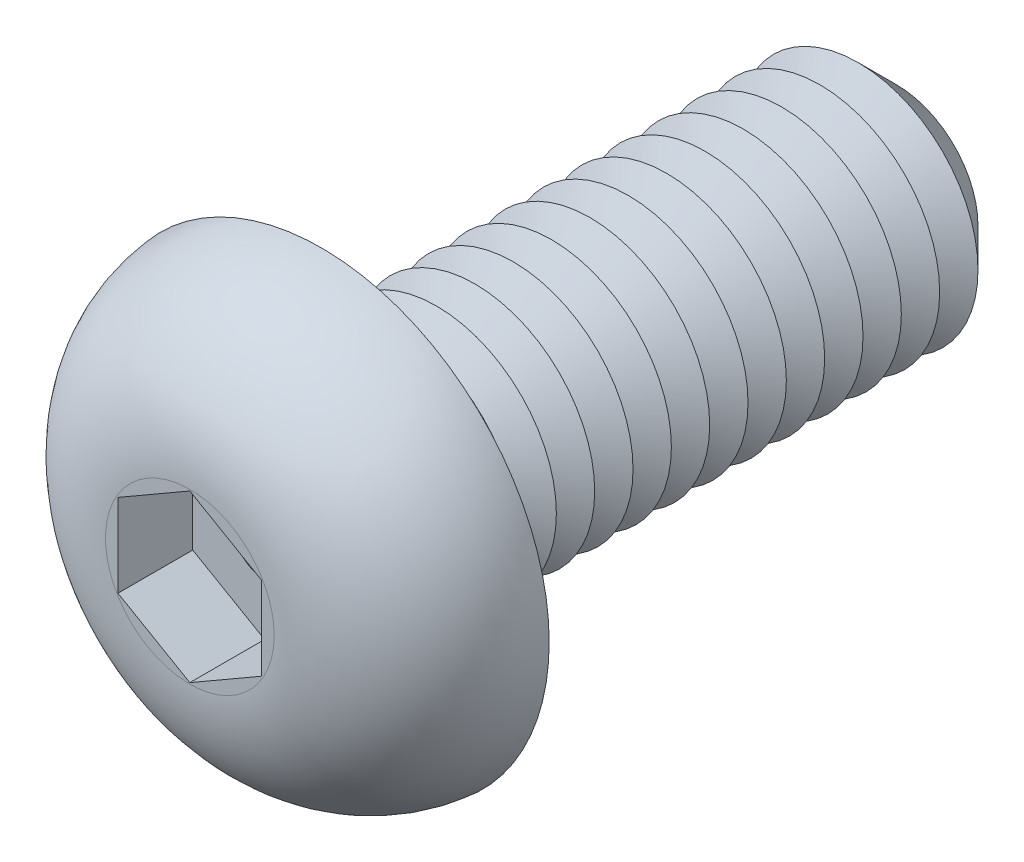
from build123d import *

# Parameters (mm, degrees)
CUT_EXTRUDE1_DEPTH  = 1.56
SKETCH4_R           = 2.5
BOSS_EXTRUDE1_DEPTH = 12
CHAMFER1_SIZE       = 0.8
LPATTERN1_COUNT     = 13
LPATTERN1_PITCH     = 0.8
FILLET2_R           = 0.4
SKETCH6_R           = 0.65
CUT_EXTRUDE2_DEPTH  = 13.19


with BuildPart() as part:
    # Sketch2 → Revolve1 (revolve)
    with BuildSketch(Plane(origin=(0, 0, 0), x_dir=(0, 0, -1), z_dir=(1, 0, 0)), mode=Mode.PRIVATE) as revolve1_sk:
        with BuildLine():
            Line((0, 0), (-2.75, 0))
            Line((-2.75, 0), (-2.75, 1.760434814))
            ThreePointArc((-2.75, 1.760434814), (-1.957940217, 3.791444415), (0, 4.75))
            Line((0, 4.75), (0, 0))
        make_face()
    revolve(revolve1_sk.sketch.rotate(Axis((0, 0, 47.934239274), (0, 0, -1)), 90), axis=Axis((0, 0, 47.934239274), (0, 0, -1)))

    # Sketch3 → Cut-Extrude1 (cut)
    with BuildSketch(Plane.XY.offset(2.75)):
        Polygon((0, 1.732050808), (-1.5, 0.866025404), (-1.5, -0.866025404), (0, -1.732050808), (1.5, -0.866025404), (1.5, 0.866025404), align=None)
    extrude(amount=-CUT_EXTRUDE1_DEPTH, mode=Mode.SUBTRACT)

    # Sketch4 → Boss-Extrude1 (add)
    with BuildSketch(Plane(origin=(0, 0, 0), x_dir=(-1, 0, 0), z_dir=(0, 0, -1))):
        with Locations(Location((0, 0, 0), (0, 0, 180))):
            Circle(SKETCH4_R)
    extrude(amount=BOSS_EXTRUDE1_DEPTH)

    # Chamfer1
    chamfer1_edges = [part.edges().sort_by_distance(p)[0] for p in [
        (-2.5, 0, -12),
    ]]
    chamfer(chamfer1_edges, length=CHAMFER1_SIZE)

    # Sketch5 → Cut-Revolve1 (revolve, cut)
    with BuildSketch(Plane(origin=(0, 0, 0), x_dir=(0, 0, -1), z_dir=(1, 0, 0)), mode=Mode.PRIVATE) as cut_revolve1_sk:
        Polygon((0.8, 2.5), (1.6, 2.5), (1.2, 1.807179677), align=None)
    cut_revolve1 = revolve(cut_revolve1_sk.sketch.rotate(Axis((0, 0, 47.934239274), (0, 0, -1)), 90), axis=Axis((0, 0, 47.934239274), (0, 0, -1)), mode=Mode.SUBTRACT)

    # LPattern1: Cut-Revolve1 ×13
    with Locations(*[(0, 0, -i * LPATTERN1_PITCH) for i in range(1, LPATTERN1_COUNT)]):
        add(cut_revolve1, mode=Mode.SUBTRACT)

    # Fillet2
    fillet2_edges = [part.edges().sort_by_distance(p)[0] for p in [
        (-2.5, 0, 0),
    ]]
    fillet(fillet2_edges, radius=FILLET2_R)

    # Sketch6 → Cut-Extrude2 (cut)
    with BuildSketch(Plane.XY.offset(1.19)):
        Circle(SKETCH6_R)
    extrude(amount=-CUT_EXTRUDE2_DEPTH, mode=Mode.SUBTRACT)


solid = part.part
